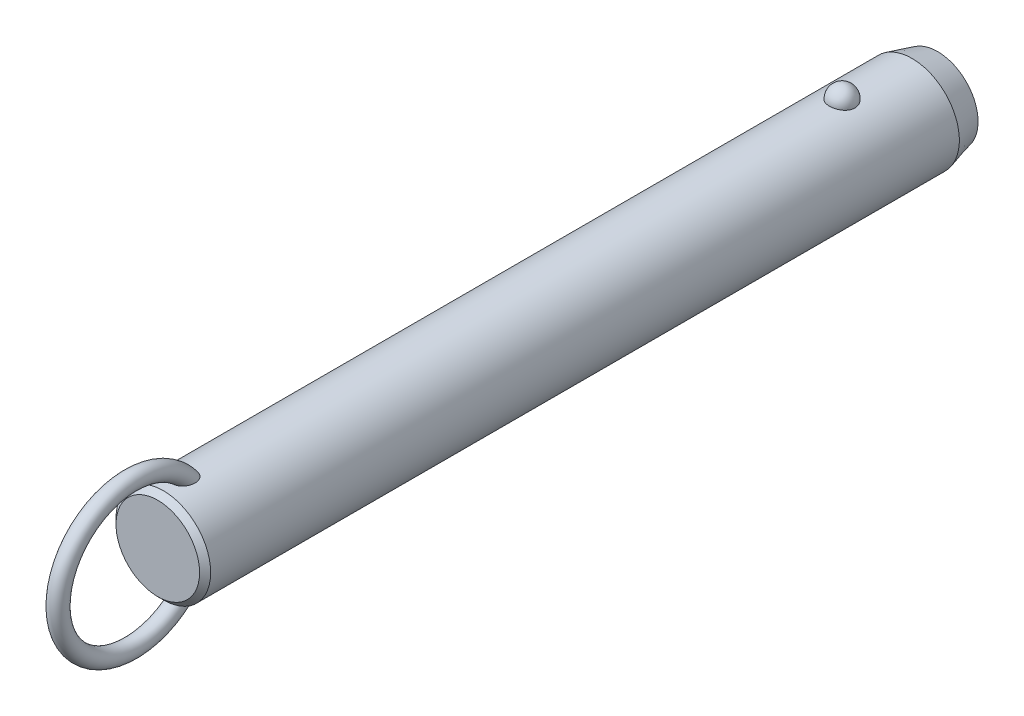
ISO-10303-21;
HEADER;
FILE_DESCRIPTION(('STEP AP214'),'2;1');
FILE_NAME('part.step','',(''),(''),'','','');
FILE_SCHEMA(('AUTOMOTIVE_DESIGN { 1 0 10303 214 1 1 1 1 }'));
ENDSEC;
DATA;
#1=APPLICATION_CONTEXT('core data for automotive mechanical design processes');
#2=APPLICATION_PROTOCOL_DEFINITION('international standard','automotive_design',2000,#1);
#3=PRODUCT_CONTEXT('',#1,'mechanical');
#4=PRODUCT('Part','Part','',(#3));
#5=PRODUCT_RELATED_PRODUCT_CATEGORY('part','',(#4));
#6=PRODUCT_DEFINITION_FORMATION('','',#4);
#7=PRODUCT_DEFINITION_CONTEXT('part definition',#1,'design');
#8=PRODUCT_DEFINITION('design','',#6,#7);
#9=PRODUCT_DEFINITION_SHAPE('','',#8);
#10=(LENGTH_UNIT() NAMED_UNIT(*) SI_UNIT(.MILLI.,.METRE.));
#11=(NAMED_UNIT(*) PLANE_ANGLE_UNIT() SI_UNIT($,.RADIAN.));
#12=(NAMED_UNIT(*) SI_UNIT($,.STERADIAN.) SOLID_ANGLE_UNIT());
#13=UNCERTAINTY_MEASURE_WITH_UNIT(LENGTH_MEASURE(1.E-05),#10,'distance_accuracy_value','');
#14=(GEOMETRIC_REPRESENTATION_CONTEXT(3) GLOBAL_UNCERTAINTY_ASSIGNED_CONTEXT((#13)) GLOBAL_UNIT_ASSIGNED_CONTEXT((#10,
#11,#12)) REPRESENTATION_CONTEXT('',''));
#15=CARTESIAN_POINT('',(0.,0.,0.));
#16=DIRECTION('',(0.,0.,1.));
#17=DIRECTION('',(1.,0.,0.));
#18=AXIS2_PLACEMENT_3D('',#15,#16,#17);
#19=CARTESIAN_POINT('',(0.,0.,144.8));
#20=DIRECTION('',(0.,0.,-1.));
#21=DIRECTION('',(-1.,0.,0.));
#22=AXIS2_PLACEMENT_3D('',#19,#20,#21);
#23=CYLINDRICAL_SURFACE('',#22,11.1);
#24=CARTESIAN_POINT('',(2.9724815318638,10.6945945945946,-3.));
#25=CARTESIAN_POINT('',(2.97247830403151,10.6945972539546,-2.83225059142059));
#26=CARTESIAN_POINT('',(2.95876598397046,10.6984356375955,-2.6644597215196));
#27=CARTESIAN_POINT('',(2.90424529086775,10.7133624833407,-2.33362381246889));
#28=CARTESIAN_POINT('',(2.8634252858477,10.7244540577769,-2.1705808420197));
#29=CARTESIAN_POINT('',(2.75573657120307,10.7526272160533,-1.85396767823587));
#30=CARTESIAN_POINT('',(2.68887937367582,10.7697061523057,-1.70039333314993));
#31=CARTESIAN_POINT('',(2.53079696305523,10.8079438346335,-1.40691598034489));
#32=CARTESIAN_POINT('',(2.43957264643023,10.8291024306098,-1.2670124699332));
#33=CARTESIAN_POINT('',(2.23458150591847,10.8732541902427,-1.00409565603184));
#34=CARTESIAN_POINT('',(2.12071295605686,10.8962553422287,-0.881162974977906));
#35=CARTESIAN_POINT('',(1.87365402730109,10.9414421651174,-0.656352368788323));
#36=CARTESIAN_POINT('',(1.74046358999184,10.9636278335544,-0.554474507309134));
#37=CARTESIAN_POINT('',(1.45872188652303,11.0046495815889,-0.374872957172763));
#38=CARTESIAN_POINT('',(1.31021276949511,11.0234944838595,-0.297085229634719));
#39=CARTESIAN_POINT('',(1.00170030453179,11.0557957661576,-0.167529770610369));
#40=CARTESIAN_POINT('',(0.841698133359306,11.0692526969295,-0.115759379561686));
#41=CARTESIAN_POINT('',(0.517607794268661,11.0890932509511,-0.0403925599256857));
#42=CARTESIAN_POINT('',(0.353633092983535,11.0955916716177,-0.0163383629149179));
#43=CARTESIAN_POINT('',(0.023842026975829,11.1011989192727,0.0044517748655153));
#44=CARTESIAN_POINT('',(-0.141974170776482,11.1003084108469,0.00119017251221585));
#45=CARTESIAN_POINT('',(-0.468405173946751,11.0912990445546,-0.0323233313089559));
#46=CARTESIAN_POINT('',(-0.629059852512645,11.0832767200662,-0.0622147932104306));
#47=CARTESIAN_POINT('',(-0.942937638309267,11.0609962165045,-0.147645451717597));
#48=CARTESIAN_POINT('',(-1.09616062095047,11.0467379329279,-0.203185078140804));
#49=CARTESIAN_POINT('',(-1.39181061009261,11.0134071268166,-0.3387529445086));
#50=CARTESIAN_POINT('',(-1.53417383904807,10.9943086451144,-0.418913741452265));
#51=CARTESIAN_POINT('',(-1.80342160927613,10.9533667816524,-0.601448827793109));
#52=CARTESIAN_POINT('',(-1.9303046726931,10.9315231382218,-0.703825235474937));
#53=CARTESIAN_POINT('',(-2.16747598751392,10.887005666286,-0.930091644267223));
#54=CARTESIAN_POINT('',(-2.27742774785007,10.8643239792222,-1.05433291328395));
#55=CARTESIAN_POINT('',(-2.47517316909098,10.8209886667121,-1.31966633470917));
#56=CARTESIAN_POINT('',(-2.56296538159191,10.8003351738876,-1.46075958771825));
#57=CARTESIAN_POINT('',(-2.71500300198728,10.7631304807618,-1.75753646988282));
#58=CARTESIAN_POINT('',(-2.77898901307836,10.7466250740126,-1.9133588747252));
#59=CARTESIAN_POINT('',(-2.88046189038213,10.7198747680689,-2.2339152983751));
#60=CARTESIAN_POINT('',(-2.91794947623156,10.709629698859,-2.39864907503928));
#61=CARTESIAN_POINT('',(-2.96537819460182,10.6965949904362,-2.73165170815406));
#62=CARTESIAN_POINT('',(-2.97542891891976,10.693775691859,-2.89990378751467));
#63=CARTESIAN_POINT('',(-2.96804271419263,10.6958279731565,-3.235752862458));
#64=CARTESIAN_POINT('',(-2.95060646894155,10.7006993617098,-3.40334987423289));
#65=CARTESIAN_POINT('',(-2.88883358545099,10.71753912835,-3.73233906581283));
#66=CARTESIAN_POINT('',(-2.84462026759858,10.7294749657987,-3.89375610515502));
#67=CARTESIAN_POINT('',(-2.73050447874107,10.7590797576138,-4.20667949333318));
#68=CARTESIAN_POINT('',(-2.66060103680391,10.7767489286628,-4.35818546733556));
#69=CARTESIAN_POINT('',(-2.49642559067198,10.8159599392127,-4.6478542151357));
#70=CARTESIAN_POINT('',(-2.40203047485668,10.8375211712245,-4.78594458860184));
#71=CARTESIAN_POINT('',(-2.19143488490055,10.8820570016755,-5.0441038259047));
#72=CARTESIAN_POINT('',(-2.07523364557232,10.9050316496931,-5.16417205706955));
#73=CARTESIAN_POINT('',(-1.82361254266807,10.9499219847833,-5.38334833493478));
#74=CARTESIAN_POINT('',(-1.68812945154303,10.9718338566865,-5.48238464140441));
#75=CARTESIAN_POINT('',(-1.40191298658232,11.0120611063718,-5.65618873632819));
#76=CARTESIAN_POINT('',(-1.25118062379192,11.0303767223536,-5.73095813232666));
#77=CARTESIAN_POINT('',(-0.94057074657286,11.0611653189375,-5.85334725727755));
#78=CARTESIAN_POINT('',(-0.780821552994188,11.0737044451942,-5.90127578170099));
#79=CARTESIAN_POINT('',(-0.455204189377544,11.0918598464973,-5.96992976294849));
#80=CARTESIAN_POINT('',(-0.289336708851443,11.0974768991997,-5.99065827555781));
#81=CARTESIAN_POINT('',(0.040684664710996,11.1011307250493,-6.00418773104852));
#82=CARTESIAN_POINT('',(0.204817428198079,11.099299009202,-5.99747318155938));
#83=CARTESIAN_POINT('',(0.529553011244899,11.088551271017,-5.9574031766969));
#84=CARTESIAN_POINT('',(0.690155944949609,11.0796354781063,-5.92404858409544));
#85=CARTESIAN_POINT('',(1.0027760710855,11.0557204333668,-5.83180084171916));
#86=CARTESIAN_POINT('',(1.15482001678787,11.0407414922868,-5.77299291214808));
#87=CARTESIAN_POINT('',(1.44678373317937,11.0062913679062,-5.63147366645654));
#88=CARTESIAN_POINT('',(1.58670279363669,10.9868199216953,-5.54876095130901));
#89=CARTESIAN_POINT('',(1.8527023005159,10.9451315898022,-5.36027644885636));
#90=CARTESIAN_POINT('',(1.97855158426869,10.9228788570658,-5.25418644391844));
#91=CARTESIAN_POINT('',(2.21080872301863,10.8782509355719,-5.02251354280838));
#92=CARTESIAN_POINT('',(2.31721312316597,10.8558757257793,-4.89692718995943));
#93=CARTESIAN_POINT('',(2.5094551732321,10.8130715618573,-4.62745408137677));
#94=CARTESIAN_POINT('',(2.59493284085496,10.7926798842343,-4.48330448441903));
#95=CARTESIAN_POINT('',(2.740862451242,10.7565495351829,-4.18236358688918));
#96=CARTESIAN_POINT('',(2.80132490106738,10.7408089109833,-4.02557762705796));
#97=CARTESIAN_POINT('',(2.88959070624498,10.7173718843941,-3.72475308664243));
#98=CARTESIAN_POINT('',(2.92062102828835,10.7088950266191,-3.58171216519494));
#99=CARTESIAN_POINT('',(2.96206765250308,10.6975052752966,-3.29245795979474));
#100=CARTESIAN_POINT('',(2.97248434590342,10.6945922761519,-3.14624473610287));
#101=CARTESIAN_POINT('',(2.9724815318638,10.6945945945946,-3.));
#102=B_SPLINE_CURVE_WITH_KNOTS('',3,(#24,#25,#26,#27,#28,#29,#30,#31,#32,#33,#34,#35,#36,#37,
#38,#39,#40,#41,#42,#43,#44,#45,#46,#47,#48,#49,#50,#51,#52,#53,#54,#55,#56,#57,#58,#59,#60,#61,
#62,#63,#64,#65,#66,#67,#68,#69,#70,#71,#72,#73,#74,#75,#76,#77,#78,#79,#80,#81,#82,#83,#84,#85,
#86,#87,#88,#89,#90,#91,#92,#93,#94,#95,#96,#97,#98,#99,#100,#101),.UNSPECIFIED.,.T.,.F.,(4,2,2,
2,2,2,2,2,2,2,2,2,2,2,2,2,2,2,2,2,2,2,2,2,2,2,2,2,2,2,2,2,2,2,2,2,2,2,4),(0.,0.502722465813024,
1.00566079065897,1.50837699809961,2.01107471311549,2.51608392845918,3.02109467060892,
3.52475118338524,4.02835620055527,4.523518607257,5.0186364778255,5.50715297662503,
5.9956776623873,6.48688002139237,6.97812923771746,7.47814366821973,7.9781907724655,
8.48353712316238,8.9888697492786,9.49218093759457,9.99547960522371,10.4964777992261,
10.997494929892,11.5010810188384,12.0046847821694,12.5099796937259,13.0152411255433,
13.5145635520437,14.0138298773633,14.5043200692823,14.9947943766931,15.4836390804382,
15.9725123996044,16.4685040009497,16.9645836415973,17.4686765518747,17.972557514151,
18.410841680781,18.849117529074),.UNSPECIFIED.);
#103=CARTESIAN_POINT('',(2.9724815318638,10.6945945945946,-3.));
#104=VERTEX_POINT('',#103);
#105=EDGE_CURVE('E41',#104,#104,#102,.T.);
#106=ORIENTED_EDGE('',*,*,#105,.T.);
#107=EDGE_LOOP('',(#106));
#108=FACE_BOUND('',#107,.T.);
#109=CARTESIAN_POINT('',(0.,0.,156.2));
#110=DIRECTION('',(0.,0.,1.));
#111=DIRECTION('',(1.,0.,0.));
#112=AXIS2_PLACEMENT_3D('',#109,#110,#111);
#113=CIRCLE('',#112,11.1);
#114=CARTESIAN_POINT('',(11.1,0.,156.2));
#115=VERTEX_POINT('',#114);
#116=EDGE_CURVE('E10',#115,#115,#113,.F.);
#117=ORIENTED_EDGE('',*,*,#116,.T.);
#118=EDGE_LOOP('',(#117));
#119=FACE_BOUND('',#118,.T.);
#120=CARTESIAN_POINT('',(-0.564520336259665,-11.0856356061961,148.457815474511));
#121=CARTESIAN_POINT('',(-0.667202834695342,-11.0804062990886,148.491283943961));
#122=CARTESIAN_POINT('',(-0.766875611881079,-11.0738877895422,148.533835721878));
#123=CARTESIAN_POINT('',(-0.957284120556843,-11.0590576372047,148.635419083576));
#124=CARTESIAN_POINT('',(-1.04801616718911,-11.0507452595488,148.69445742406));
#125=CARTESIAN_POINT('',(-1.21800952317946,-11.0333016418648,148.826529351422));
#126=CARTESIAN_POINT('',(-1.29730805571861,-11.0241732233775,148.899515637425));
#127=CARTESIAN_POINT('',(-1.44337665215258,-11.0060026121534,149.057037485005));
#128=CARTESIAN_POINT('',(-1.51014622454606,-10.9969604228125,149.141573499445));
#129=CARTESIAN_POINT('',(-1.63454620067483,-10.9791841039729,149.325521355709));
#130=CARTESIAN_POINT('',(-1.69127003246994,-10.9705107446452,149.425549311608));
#131=CARTESIAN_POINT('',(-1.7898078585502,-10.9548648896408,149.632790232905));
#132=CARTESIAN_POINT('',(-1.83161214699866,-10.9478935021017,149.740007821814));
#133=CARTESIAN_POINT('',(-1.91557028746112,-10.9335803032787,150.005408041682));
#134=CARTESIAN_POINT('',(-1.95040620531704,-10.9273269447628,150.165980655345));
#135=CARTESIAN_POINT('',(-1.99388326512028,-10.9194709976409,150.490697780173));
#136=CARTESIAN_POINT('',(-2.00248051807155,-10.9178762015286,150.654847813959));
#137=CARTESIAN_POINT('',(-1.99551615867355,-10.9191578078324,151.024650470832));
#138=CARTESIAN_POINT('',(-1.97322066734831,-10.9232807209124,151.230191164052));
#139=CARTESIAN_POINT('',(-1.91529761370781,-10.9335244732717,151.533595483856));
#140=CARTESIAN_POINT('',(-1.89184575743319,-10.9376266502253,151.634088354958));
#141=CARTESIAN_POINT('',(-1.83700674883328,-10.9469720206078,151.832855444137));
#142=CARTESIAN_POINT('',(-1.80562070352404,-10.9522150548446,151.931129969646));
#143=CARTESIAN_POINT('',(-1.73463055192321,-10.9636837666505,152.125914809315));
#144=CARTESIAN_POINT('',(-1.6949341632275,-10.9699202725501,152.222390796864));
#145=CARTESIAN_POINT('',(-1.60745141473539,-10.9830806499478,152.411626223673));
#146=CARTESIAN_POINT('',(-1.55966150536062,-10.9900048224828,152.504384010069));
#147=CARTESIAN_POINT('',(-1.45591812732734,-11.0042280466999,152.684690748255));
#148=CARTESIAN_POINT('',(-1.40000013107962,-11.0115253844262,152.772260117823));
#149=CARTESIAN_POINT('',(-1.27937470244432,-11.0261911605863,152.941029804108));
#150=CARTESIAN_POINT('',(-1.21467835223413,-11.0335594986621,153.02223795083));
#151=CARTESIAN_POINT('',(-1.08218150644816,-11.0473027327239,153.169001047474));
#152=CARTESIAN_POINT('',(-1.01522633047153,-11.0537063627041,153.235309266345));
#153=CARTESIAN_POINT('',(-0.872952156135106,-11.065850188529,153.358378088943));
#154=CARTESIAN_POINT('',(-0.797642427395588,-11.0715911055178,153.415149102));
#155=CARTESIAN_POINT('',(-0.65139686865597,-11.081071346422,153.507515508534));
#156=CARTESIAN_POINT('',(-0.581712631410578,-11.0849841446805,153.545049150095));
#157=CARTESIAN_POINT('',(-0.437066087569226,-11.0916271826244,153.608259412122));
#158=CARTESIAN_POINT('',(-0.362109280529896,-11.0943586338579,153.633948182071));
#159=CARTESIAN_POINT('',(-0.207828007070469,-11.0983242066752,153.671117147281));
#160=CARTESIAN_POINT('',(-0.128467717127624,-11.0995432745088,153.682454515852));
#161=CARTESIAN_POINT('',(0.0309101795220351,-11.1002423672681,153.688965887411));
#162=CARTESIAN_POINT('',(0.110927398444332,-11.0997233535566,153.684148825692));
#163=CARTESIAN_POINT('',(0.256406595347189,-11.097240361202,153.660959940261));
#164=CARTESIAN_POINT('',(0.322235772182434,-11.0955074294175,153.644754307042));
#165=CARTESIAN_POINT('',(0.450635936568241,-11.0910350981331,153.602600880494));
#166=CARTESIAN_POINT('',(0.513205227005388,-11.0882951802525,153.576648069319));
#167=CARTESIAN_POINT('',(0.662626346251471,-11.0805620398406,153.502607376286));
#168=CARTESIAN_POINT('',(0.747127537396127,-11.0751144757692,153.449845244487));
#169=CARTESIAN_POINT('',(0.906756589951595,-11.0631932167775,153.331720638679));
#170=CARTESIAN_POINT('',(0.981859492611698,-11.0567168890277,153.266325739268));
#171=CARTESIAN_POINT('',(1.10712207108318,-11.0447856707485,153.14226337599));
#172=CARTESIAN_POINT('',(1.15909566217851,-11.0394280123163,153.085383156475));
#173=CARTESIAN_POINT('',(1.25791923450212,-11.0286040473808,152.967327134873));
#174=CARTESIAN_POINT('',(1.30476642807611,-11.0231376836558,152.906149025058));
#175=CARTESIAN_POINT('',(1.43818612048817,-11.0068027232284,152.717305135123));
#176=CARTESIAN_POINT('',(1.51751767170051,-10.9960104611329,152.584453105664));
#177=CARTESIAN_POINT('',(1.63597546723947,-10.9788847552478,152.353137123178));
#178=CARTESIAN_POINT('',(1.6798887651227,-10.9722190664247,152.257053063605));
#179=CARTESIAN_POINT('',(1.75953241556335,-10.9597298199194,152.061431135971));
#180=CARTESIAN_POINT('',(1.79525967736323,-10.9539065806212,151.961891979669));
#181=CARTESIAN_POINT('',(1.85844731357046,-10.9433632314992,151.76021118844));
#182=CARTESIAN_POINT('',(1.88591073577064,-10.9386427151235,151.65807052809));
#183=CARTESIAN_POINT('',(1.9323432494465,-10.9305350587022,151.451819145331));
#184=CARTESIAN_POINT('',(1.95131065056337,-10.9271481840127,151.347708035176));
#185=CARTESIAN_POINT('',(1.99040203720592,-10.9201183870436,151.065458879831));
#186=CARTESIAN_POINT('',(2.00221217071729,-10.9179256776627,150.886037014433));
#187=CARTESIAN_POINT('',(1.99711676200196,-10.9188636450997,150.527713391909));
#188=CARTESIAN_POINT('',(1.98026150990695,-10.9219849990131,150.348811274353));
#189=CARTESIAN_POINT('',(1.92151657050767,-10.9324473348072,150.03645144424));
#190=CARTESIAN_POINT('',(1.88605081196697,-10.9386915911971,149.901759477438));
#191=CARTESIAN_POINT('',(1.79393020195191,-10.9541780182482,149.639966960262));
#192=CARTESIAN_POINT('',(1.73729868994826,-10.9634168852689,149.512858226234));
#193=CARTESIAN_POINT('',(1.612370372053,-10.9824218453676,149.289418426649));
#194=CARTESIAN_POINT('',(1.54715374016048,-10.9918945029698,149.191345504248));
#195=CARTESIAN_POINT('',(1.40127026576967,-11.0114415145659,149.007434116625));
#196=CARTESIAN_POINT('',(1.32060742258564,-11.0215157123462,148.921592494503));
#197=CARTESIAN_POINT('',(1.14474787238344,-11.041168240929,148.765163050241));
#198=CARTESIAN_POINT('',(1.04947805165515,-11.0507437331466,148.694656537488));
#199=CARTESIAN_POINT('',(0.847278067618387,-11.0680789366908,148.572640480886));
#200=CARTESIAN_POINT('',(0.740351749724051,-11.0758392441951,148.521124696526));
#201=CARTESIAN_POINT('',(0.529289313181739,-11.0878275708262,148.443485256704));
#202=CARTESIAN_POINT('',(0.425895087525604,-11.0923259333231,148.415377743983));
#203=CARTESIAN_POINT('',(0.215723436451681,-11.0984001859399,148.377703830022));
#204=CARTESIAN_POINT('',(0.108947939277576,-11.0999777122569,148.368127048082));
#205=CARTESIAN_POINT('',(-0.0938962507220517,-11.1000196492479,148.367877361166));
#206=CARTESIAN_POINT('',(-0.189967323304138,-11.0987797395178,148.375408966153));
#207=CARTESIAN_POINT('',(-0.379657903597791,-11.0939111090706,148.405507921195));
#208=CARTESIAN_POINT('',(-0.473277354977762,-11.0902823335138,148.428075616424));
#209=CARTESIAN_POINT('',(-0.564520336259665,-11.0856356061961,148.457815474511));
#210=B_SPLINE_CURVE_WITH_KNOTS('',3,(#120,#121,#122,#123,#124,#125,#126,#127,#128,#129,#130,
#131,#132,#133,#134,#135,#136,#137,#138,#139,#140,#141,#142,#143,#144,#145,#146,#147,#148,#149,
#150,#151,#152,#153,#154,#155,#156,#157,#158,#159,#160,#161,#162,#163,#164,#165,#166,#167,#168,
#169,#170,#171,#172,#173,#174,#175,#176,#177,#178,#179,#180,#181,#182,#183,#184,#185,#186,#187,
#188,#189,#190,#191,#192,#193,#194,#195,#196,#197,#198,#199,#200,#201,#202,#203,#204,#205,#206,
#207,#208,#209),.UNSPECIFIED.,.T.,.F.,(4,2,2,2,2,2,2,2,2,2,2,2,2,2,2,2,2,2,2,2,2,2,2,2,2,2,2,2,
2,2,2,2,2,2,2,2,2,2,2,2,2,2,2,2,4),(0.,0.323999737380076,0.648132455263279,0.971184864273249,
1.29424994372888,1.63886237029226,1.98369857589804,2.47426059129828,2.96564271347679,
3.58257396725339,3.89215258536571,4.20168803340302,4.51486273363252,4.82817514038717,
5.14015911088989,5.45175282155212,5.73442856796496,6.01679375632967,6.25364580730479,
6.49025437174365,6.7291996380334,6.96801276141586,7.17061258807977,7.37331685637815,
7.6709498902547,7.96935728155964,8.20075067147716,8.43226927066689,8.89581623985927,
9.21306533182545,9.53043400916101,9.84768549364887,10.1650000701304,10.70229304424,
11.2386443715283,11.6553390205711,12.0715755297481,12.4245637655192,12.7774607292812,
13.1321855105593,13.4867936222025,13.8068771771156,14.1267813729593,14.4146787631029,
14.7025827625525),.UNSPECIFIED.);
#211=CARTESIAN_POINT('',(-0.564520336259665,-11.0856356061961,148.457815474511));
#212=VERTEX_POINT('',#211);
#213=EDGE_CURVE('E59',#212,#212,#210,.T.);
#214=ORIENTED_EDGE('',*,*,#213,.T.);
#215=EDGE_LOOP('',(#214));
#216=FACE_BOUND('',#215,.T.);
#217=CARTESIAN_POINT('',(-0.564520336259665,11.0856356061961,148.457815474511));
#218=CARTESIAN_POINT('',(-0.46854206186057,11.0905203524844,148.426545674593));
#219=CARTESIAN_POINT('',(-0.369793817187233,11.0942886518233,148.403157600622));
#220=CARTESIAN_POINT('',(-0.169555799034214,11.0991586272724,148.373085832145));
#221=CARTESIAN_POINT('',(-0.0680604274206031,11.1002543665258,148.36643932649));
#222=CARTESIAN_POINT('',(0.13454973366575,11.099646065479,148.370157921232));
#223=CARTESIAN_POINT('',(0.235664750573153,11.0979441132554,148.38051033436));
#224=CARTESIAN_POINT('',(0.434632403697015,11.0919342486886,148.417831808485));
#225=CARTESIAN_POINT('',(0.532486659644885,11.0876276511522,148.444792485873));
#226=CARTESIAN_POINT('',(0.722445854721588,11.0768742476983,148.5144096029));
#227=CARTESIAN_POINT('',(0.814543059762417,11.0704246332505,148.557086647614));
#228=CARTESIAN_POINT('',(0.990565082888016,11.0560659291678,148.656648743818));
#229=CARTESIAN_POINT('',(1.07448844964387,11.048156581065,148.713536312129));
#230=CARTESIAN_POINT('',(1.23562672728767,11.0313221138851,148.842210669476));
#231=CARTESIAN_POINT('',(1.3124268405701,11.0223686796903,148.914511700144));
#232=CARTESIAN_POINT('',(1.45398030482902,11.0045918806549,149.070042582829));
#233=CARTESIAN_POINT('',(1.51873073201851,10.9957685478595,149.153275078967));
#234=CARTESIAN_POINT('',(1.64107232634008,10.9782087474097,149.336384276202));
#235=CARTESIAN_POINT('',(1.6974317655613,10.9695572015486,149.437089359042));
#236=CARTESIAN_POINT('',(1.79515063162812,10.9539887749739,149.645626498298));
#237=CARTESIAN_POINT('',(1.83649966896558,10.9470730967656,149.75346343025));
#238=CARTESIAN_POINT('',(1.91931148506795,10.9329211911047,150.020399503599));
#239=CARTESIAN_POINT('',(1.95340104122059,10.9267904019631,150.181861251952));
#240=CARTESIAN_POINT('',(1.99526195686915,10.9192174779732,150.50821631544));
#241=CARTESIAN_POINT('',(2.00298989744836,10.9177830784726,150.67311484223));
#242=CARTESIAN_POINT('',(1.99396251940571,10.9194420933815,151.044100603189));
#243=CARTESIAN_POINT('',(1.97050829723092,10.923774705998,151.25003871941));
#244=CARTESIAN_POINT('',(1.91079643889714,10.9343131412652,151.553901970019));
#245=CARTESIAN_POINT('',(1.88673702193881,10.9385106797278,151.654529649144));
#246=CARTESIAN_POINT('',(1.8306550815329,10.9480376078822,151.853510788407));
#247=CARTESIAN_POINT('',(1.79863369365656,10.9533668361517,151.951864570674));
#248=CARTESIAN_POINT('',(1.72633365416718,10.9649954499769,152.146720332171));
#249=CARTESIAN_POINT('',(1.68596409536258,10.9713053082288,152.24318790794));
#250=CARTESIAN_POINT('',(1.59707998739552,10.9845964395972,152.432323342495));
#251=CARTESIAN_POINT('',(1.54856169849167,10.9915780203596,152.524989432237));
#252=CARTESIAN_POINT('',(1.44330168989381,11.0058935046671,152.704975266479));
#253=CARTESIAN_POINT('',(1.3865974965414,11.0132257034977,152.792316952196));
#254=CARTESIAN_POINT('',(1.26431158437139,11.0279330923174,152.960456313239));
#255=CARTESIAN_POINT('',(1.198741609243,11.0353082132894,153.041262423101));
#256=CARTESIAN_POINT('',(1.06542088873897,11.048931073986,153.185985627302));
#257=CARTESIAN_POINT('',(0.998640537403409,11.0552153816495,153.250784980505));
#258=CARTESIAN_POINT('',(0.856896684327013,11.0671032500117,153.370846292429));
#259=CARTESIAN_POINT('',(0.781942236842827,11.0727075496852,153.426118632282));
#260=CARTESIAN_POINT('',(0.636276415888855,11.081949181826,153.515972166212));
#261=CARTESIAN_POINT('',(0.566755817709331,11.0857572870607,153.552441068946));
#262=CARTESIAN_POINT('',(0.422602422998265,11.0921860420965,153.613533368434));
#263=CARTESIAN_POINT('',(0.347974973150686,11.0948079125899,153.638168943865));
#264=CARTESIAN_POINT('',(0.194593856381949,11.0985608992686,153.673323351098));
#265=CARTESIAN_POINT('',(0.115807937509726,11.0996777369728,153.683706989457));
#266=CARTESIAN_POINT('',(-0.0422499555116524,11.1002003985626,153.688574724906));
#267=CARTESIAN_POINT('',(-0.121521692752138,11.09960699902,153.683066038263));
#268=CARTESIAN_POINT('',(-0.266046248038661,11.0970123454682,153.658827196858));
#269=CARTESIAN_POINT('',(-0.331661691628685,11.0952283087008,153.642135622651));
#270=CARTESIAN_POINT('',(-0.459588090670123,11.0906663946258,153.599111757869));
#271=CARTESIAN_POINT('',(-0.521897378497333,11.0878880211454,153.572774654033));
#272=CARTESIAN_POINT('',(-0.671446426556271,11.0800342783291,153.497513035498));
#273=CARTESIAN_POINT('',(-0.756250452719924,11.0744969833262,153.443818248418));
#274=CARTESIAN_POINT('',(-0.916349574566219,11.0624045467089,153.323802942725));
#275=CARTESIAN_POINT('',(-0.991618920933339,11.0558467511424,153.257449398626));
#276=CARTESIAN_POINT('',(-1.11713140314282,11.0437783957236,153.131633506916));
#277=CARTESIAN_POINT('',(-1.16920539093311,11.0383619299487,153.073952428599));
#278=CARTESIAN_POINT('',(-1.2681747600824,11.02743010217,152.954280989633));
#279=CARTESIAN_POINT('',(-1.31506731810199,11.0219146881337,152.892288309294));
#280=CARTESIAN_POINT('',(-1.40399813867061,11.0109399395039,152.764784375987));
#281=CARTESIAN_POINT('',(-1.44602864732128,11.0054807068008,152.699267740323));
#282=CARTESIAN_POINT('',(-1.52538779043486,10.9947621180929,152.565422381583));
#283=CARTESIAN_POINT('',(-1.56271516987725,10.9895028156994,152.497092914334));
#284=CARTESIAN_POINT('',(-1.64537943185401,10.9774790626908,152.333210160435));
#285=CARTESIAN_POINT('',(-1.68879497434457,10.9708503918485,152.2366735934));
#286=CARTESIAN_POINT('',(-1.76740738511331,10.9584602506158,152.040236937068));
#287=CARTESIAN_POINT('',(-1.80260120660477,10.95269910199,151.94033561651));
#288=CARTESIAN_POINT('',(-1.86468657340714,10.9423003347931,151.737966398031));
#289=CARTESIAN_POINT('',(-1.8915816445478,10.9376622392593,151.635499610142));
#290=CARTESIAN_POINT('',(-1.93682458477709,10.9297405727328,151.428642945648));
#291=CARTESIAN_POINT('',(-1.95517082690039,10.9264572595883,151.324252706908));
#292=CARTESIAN_POINT('',(-1.99232562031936,10.9197647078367,151.04262876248));
#293=CARTESIAN_POINT('',(-2.00294603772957,10.9177914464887,150.864185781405));
#294=CARTESIAN_POINT('',(-1.99566675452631,10.9191290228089,150.507996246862));
#295=CARTESIAN_POINT('',(-1.97781651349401,10.9224306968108,150.33024902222));
#296=CARTESIAN_POINT('',(-1.91747214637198,10.9331592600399,150.019792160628));
#297=CARTESIAN_POINT('',(-1.88131022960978,10.9395108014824,149.885825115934));
#298=CARTESIAN_POINT('',(-1.78790380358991,10.9551659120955,149.62559757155));
#299=CARTESIAN_POINT('',(-1.7306830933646,10.9644661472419,149.499328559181));
#300=CARTESIAN_POINT('',(-1.60475573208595,10.9835398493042,149.27741565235));
#301=CARTESIAN_POINT('',(-1.53908879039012,10.9930297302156,149.180026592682));
#302=CARTESIAN_POINT('',(-1.39238608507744,11.0125708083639,148.997525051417));
#303=CARTESIAN_POINT('',(-1.31135150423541,11.0226219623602,148.912411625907));
#304=CARTESIAN_POINT('',(-1.14382035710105,11.0411991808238,148.76529943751));
#305=CARTESIAN_POINT('',(-1.05858500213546,11.0497792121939,148.70186930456));
#306=CARTESIAN_POINT('',(-0.87872344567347,11.0655285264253,148.590250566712));
#307=CARTESIAN_POINT('',(-0.78412346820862,11.0727015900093,148.542020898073));
#308=CARTESIAN_POINT('',(-0.646163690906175,11.0812501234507,148.486023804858));
#309=CARTESIAN_POINT('',(-0.605595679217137,11.0835451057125,148.471197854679));
#310=CARTESIAN_POINT('',(-0.564520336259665,11.0856356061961,148.457815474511));
#311=B_SPLINE_CURVE_WITH_KNOTS('',3,(#217,#218,#219,#220,#221,#222,#223,#224,#225,#226,#227,
#228,#229,#230,#231,#232,#233,#234,#235,#236,#237,#238,#239,#240,#241,#242,#243,#244,#245,#246,
#247,#248,#249,#250,#251,#252,#253,#254,#255,#256,#257,#258,#259,#260,#261,#262,#263,#264,#265,
#266,#267,#268,#269,#270,#271,#272,#273,#274,#275,#276,#277,#278,#279,#280,#281,#282,#283,#284,
#285,#286,#287,#288,#289,#290,#291,#292,#293,#294,#295,#296,#297,#298,#299,#300,#301,#302,#303,
#304,#305,#306,#307,#308,#309,#310),.UNSPECIFIED.,.T.,.F.,(4,2,2,2,2,2,2,2,2,2,2,2,2,2,2,2,2,2,
2,2,2,2,2,2,2,2,2,2,2,2,2,2,2,2,2,2,2,2,2,2,2,2,2,2,2,2,4),(0.,0.303061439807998,
0.606795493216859,0.910302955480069,1.21365733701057,1.51741085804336,1.82121821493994,
2.13745205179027,2.45376252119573,2.79958678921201,3.14564996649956,3.63832391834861,
4.13180893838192,4.75031912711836,5.06071926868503,5.37107516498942,5.68500772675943,
5.99908475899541,6.31176519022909,6.62403542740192,6.90315673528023,7.18197194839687,
7.41687778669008,7.65154134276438,7.88841587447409,8.12518286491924,8.32752842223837,
8.52997509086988,8.82986421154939,9.13054668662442,9.3639350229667,9.5974499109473,
9.83133221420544,10.0652767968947,10.3830324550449,10.7009056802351,11.0186436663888,
11.3364420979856,11.8705925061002,12.4038159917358,12.8189662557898,13.2336487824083,
13.5857049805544,13.9377340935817,14.2561354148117,14.5736690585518,14.7033687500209),.UNSPECIFIED.);
#312=CARTESIAN_POINT('',(-0.564520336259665,11.0856356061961,148.457815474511));
#313=VERTEX_POINT('',#312);
#314=EDGE_CURVE('E67',#313,#313,#311,.T.);
#315=ORIENTED_EDGE('',*,*,#314,.T.);
#316=EDGE_LOOP('',(#315));
#317=FACE_BOUND('',#316,.T.);
#318=CARTESIAN_POINT('',(0.,0.,-19.4000000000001));
#319=DIRECTION('',(0.,0.,-1.));
#320=DIRECTION('',(-1.,0.,0.));
#321=AXIS2_PLACEMENT_3D('',#318,#319,#320);
#322=CIRCLE('',#321,11.1);
#323=CARTESIAN_POINT('',(-11.1,0.,-19.4000000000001));
#324=VERTEX_POINT('',#323);
#325=EDGE_CURVE('E56',#324,#324,#322,.F.);
#326=ORIENTED_EDGE('',*,*,#325,.T.);
#327=EDGE_LOOP('',(#326));
#328=FACE_BOUND('',#327,.T.);
#329=ADVANCED_FACE('F37',(#108,#119,#216,#317,#328),#23,.T.);
#330=CARTESIAN_POINT('',(0.,0.,-25.4));
#331=DIRECTION('',(0.,0.,-1.));
#332=DIRECTION('',(-1.,0.,0.));
#333=AXIS2_PLACEMENT_3D('',#330,#331,#332);
#334=PLANE('',#333);
#335=CARTESIAN_POINT('',(0.,0.,-25.4));
#336=DIRECTION('',(0.,0.,-1.));
#337=DIRECTION('',(-1.,0.,0.));
#338=AXIS2_PLACEMENT_3D('',#335,#336,#337);
#339=CIRCLE('',#338,9.49230484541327);
#340=CARTESIAN_POINT('',(-9.49230484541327,0.,-25.4));
#341=VERTEX_POINT('',#340);
#342=EDGE_CURVE('E66',#341,#341,#339,.T.);
#343=ORIENTED_EDGE('',*,*,#342,.T.);
#344=EDGE_LOOP('',(#343));
#345=FACE_BOUND('',#344,.T.);
#346=ADVANCED_FACE('F85',(#345),#334,.T.);
#347=CARTESIAN_POINT('',(0.,0.,-25.4));
#348=DIRECTION('',(0.,0.,1.));
#349=DIRECTION('',(1.,0.,0.));
#350=AXIS2_PLACEMENT_3D('',#347,#348,#349);
#351=CONICAL_SURFACE('',#350,9.49230484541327,0.261799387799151);
#352=ORIENTED_EDGE('',*,*,#325,.F.);
#353=EDGE_LOOP('',(#352));
#354=FACE_BOUND('',#353,.T.);
#355=ORIENTED_EDGE('',*,*,#342,.F.);
#356=EDGE_LOOP('',(#355));
#357=FACE_BOUND('',#356,.T.);
#358=ADVANCED_FACE('F83',(#354,#357),#351,.T.);
#359=CARTESIAN_POINT('',(0.,0.,157.5));
#360=DIRECTION('',(0.,0.,1.));
#361=DIRECTION('',(1.,0.,0.));
#362=AXIS2_PLACEMENT_3D('',#359,#360,#361);
#363=PLANE('',#362);
#364=CARTESIAN_POINT('',(0.,0.,157.5));
#365=DIRECTION('',(0.,0.,1.));
#366=DIRECTION('',(1.,0.,0.));
#367=AXIS2_PLACEMENT_3D('',#364,#365,#366);
#368=CIRCLE('',#367,9.80000000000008);
#369=CARTESIAN_POINT('',(9.80000000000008,0.,157.5));
#370=VERTEX_POINT('',#369);
#371=EDGE_CURVE('E50',#370,#370,#368,.T.);
#372=ORIENTED_EDGE('',*,*,#371,.T.);
#373=EDGE_LOOP('',(#372));
#374=FACE_BOUND('',#373,.T.);
#375=ADVANCED_FACE('F77',(#374),#363,.T.);
#376=CARTESIAN_POINT('',(0.,0.,163.85));
#377=DIRECTION('',(1.,0.,0.));
#378=DIRECTION('',(0.,0.,-1.));
#379=AXIS2_PLACEMENT_3D('',#376,#377,#378);
#380=TOROIDAL_SURFACE('',#379,17.05,2.);
#381=ORIENTED_EDGE('',*,*,#314,.F.);
#382=EDGE_LOOP('',(#381));
#383=FACE_BOUND('',#382,.T.);
#384=ORIENTED_EDGE('',*,*,#213,.F.);
#385=EDGE_LOOP('',(#384));
#386=FACE_BOUND('',#385,.T.);
#387=ADVANCED_FACE('F73',(#383,#386),#380,.T.);
#388=CARTESIAN_POINT('',(0.,0.,157.5));
#389=DIRECTION('',(0.,0.,-1.));
#390=DIRECTION('',(-1.,0.,0.));
#391=AXIS2_PLACEMENT_3D('',#388,#389,#390);
#392=CONICAL_SURFACE('',#391,9.80000000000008,0.78539816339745);
#393=ORIENTED_EDGE('',*,*,#116,.F.);
#394=EDGE_LOOP('',(#393));
#395=FACE_BOUND('',#394,.T.);
#396=ORIENTED_EDGE('',*,*,#371,.F.);
#397=EDGE_LOOP('',(#396));
#398=FACE_BOUND('',#397,.T.);
#399=ADVANCED_FACE('F39',(#395,#398),#392,.T.);
#400=CARTESIAN_POINT('',(0.,11.1,-3.));
#401=DIRECTION('',(0.,1.,0.));
#402=DIRECTION('',(0.,0.,-1.));
#403=AXIS2_PLACEMENT_3D('',#400,#401,#402);
#404=SPHERICAL_SURFACE('',#403,3.);
#405=ORIENTED_EDGE('',*,*,#105,.F.);
#406=EDGE_LOOP('',(#405));
#407=FACE_BOUND('',#406,.T.);
#408=ADVANCED_FACE('F79',(#407),#404,.T.);
#409=CLOSED_SHELL('',(#329,#346,#358,#375,#387,#399,#408));
#410=MANIFOLD_SOLID_BREP('B2',#409);
#411=ADVANCED_BREP_SHAPE_REPRESENTATION('',(#18,#410),#14);
#412=SHAPE_DEFINITION_REPRESENTATION(#9,#411);
ENDSEC;
END-ISO-10303-21;
